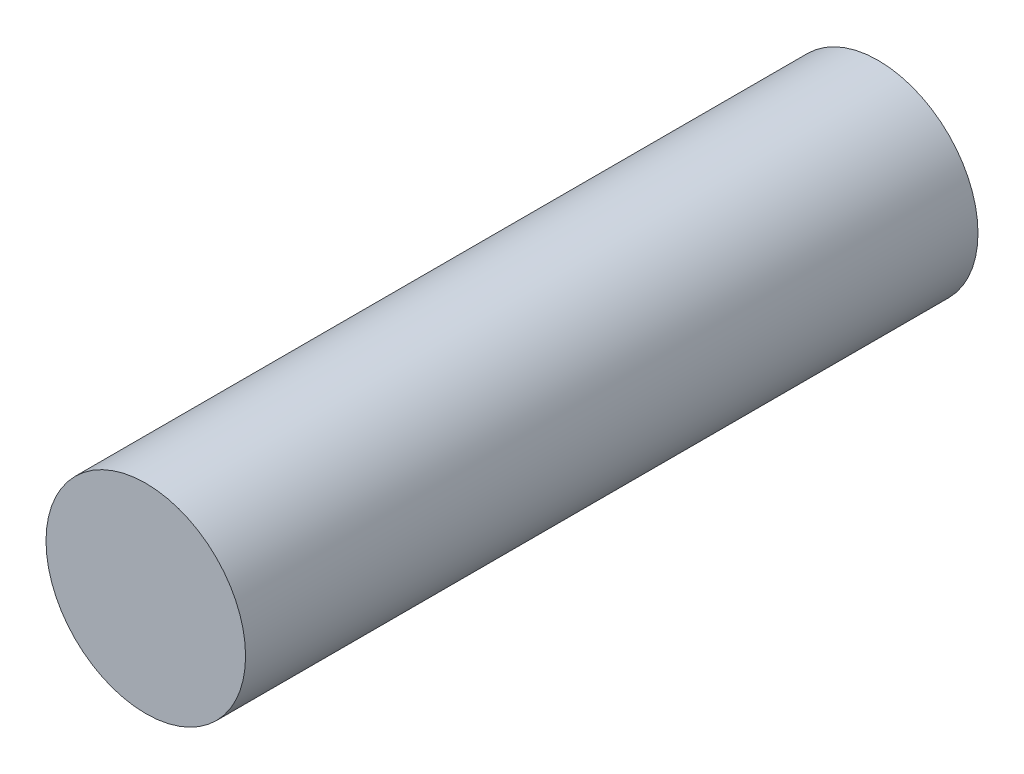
ISO-10303-21;
HEADER;
FILE_DESCRIPTION(('STEP AP214'),'2;1');
FILE_NAME('part.step','',(''),(''),'','','');
FILE_SCHEMA(('AUTOMOTIVE_DESIGN { 1 0 10303 214 1 1 1 1 }'));
ENDSEC;
DATA;
#1=APPLICATION_CONTEXT('core data for automotive mechanical design processes');
#2=APPLICATION_PROTOCOL_DEFINITION('international standard','automotive_design',2000,#1);
#3=PRODUCT_CONTEXT('',#1,'mechanical');
#4=PRODUCT('Part','Part','',(#3));
#5=PRODUCT_RELATED_PRODUCT_CATEGORY('part','',(#4));
#6=PRODUCT_DEFINITION_FORMATION('','',#4);
#7=PRODUCT_DEFINITION_CONTEXT('part definition',#1,'design');
#8=PRODUCT_DEFINITION('design','',#6,#7);
#9=PRODUCT_DEFINITION_SHAPE('','',#8);
#10=(LENGTH_UNIT() NAMED_UNIT(*) SI_UNIT(.MILLI.,.METRE.));
#11=(NAMED_UNIT(*) PLANE_ANGLE_UNIT() SI_UNIT($,.RADIAN.));
#12=(NAMED_UNIT(*) SI_UNIT($,.STERADIAN.) SOLID_ANGLE_UNIT());
#13=UNCERTAINTY_MEASURE_WITH_UNIT(LENGTH_MEASURE(1.E-05),#10,'distance_accuracy_value','');
#14=(GEOMETRIC_REPRESENTATION_CONTEXT(3) GLOBAL_UNCERTAINTY_ASSIGNED_CONTEXT((#13)) GLOBAL_UNIT_ASSIGNED_CONTEXT((#10,
#11,#12)) REPRESENTATION_CONTEXT('',''));
#15=CARTESIAN_POINT('',(0.,0.,0.));
#16=DIRECTION('',(0.,0.,1.));
#17=DIRECTION('',(1.,0.,0.));
#18=AXIS2_PLACEMENT_3D('',#15,#16,#17);
#19=CARTESIAN_POINT('',(0.,0.,17.526));
#20=DIRECTION('',(0.,0.,-1.));
#21=DIRECTION('',(-1.,0.,0.));
#22=AXIS2_PLACEMENT_3D('',#19,#20,#21);
#23=CYLINDRICAL_SURFACE('',#22,2.3876);
#24=CARTESIAN_POINT('',(0.,0.,17.526));
#25=DIRECTION('',(0.,0.,1.));
#26=DIRECTION('',(1.,0.,0.));
#27=AXIS2_PLACEMENT_3D('',#24,#25,#26);
#28=CIRCLE('',#27,2.3876);
#29=CARTESIAN_POINT('',(2.3876,0.,17.526));
#30=VERTEX_POINT('',#29);
#31=EDGE_CURVE('E10',#30,#30,#28,.T.);
#32=ORIENTED_EDGE('',*,*,#31,.F.);
#33=EDGE_LOOP('',(#32));
#34=FACE_BOUND('',#33,.T.);
#35=CARTESIAN_POINT('',(0.,0.,0.));
#36=DIRECTION('',(0.,0.,1.));
#37=DIRECTION('',(1.,0.,0.));
#38=AXIS2_PLACEMENT_3D('',#35,#36,#37);
#39=CIRCLE('',#38,2.3876);
#40=CARTESIAN_POINT('',(2.3876,0.,0.));
#41=VERTEX_POINT('',#40);
#42=EDGE_CURVE('E36',#41,#41,#39,.T.);
#43=ORIENTED_EDGE('',*,*,#42,.T.);
#44=EDGE_LOOP('',(#43));
#45=FACE_BOUND('',#44,.T.);
#46=ADVANCED_FACE('F30',(#34,#45),#23,.T.);
#47=CARTESIAN_POINT('',(0.,0.,17.526));
#48=DIRECTION('',(0.,0.,1.));
#49=DIRECTION('',(1.,0.,0.));
#50=AXIS2_PLACEMENT_3D('',#47,#48,#49);
#51=PLANE('',#50);
#52=ORIENTED_EDGE('',*,*,#31,.T.);
#53=EDGE_LOOP('',(#52));
#54=FACE_BOUND('',#53,.T.);
#55=ADVANCED_FACE('F45',(#54),#51,.T.);
#56=CARTESIAN_POINT('',(0.,0.,0.));
#57=DIRECTION('',(0.,0.,1.));
#58=DIRECTION('',(1.,0.,0.));
#59=AXIS2_PLACEMENT_3D('',#56,#57,#58);
#60=PLANE('',#59);
#61=ORIENTED_EDGE('',*,*,#42,.F.);
#62=EDGE_LOOP('',(#61));
#63=FACE_BOUND('',#62,.T.);
#64=ADVANCED_FACE('F43',(#63),#60,.F.);
#65=CLOSED_SHELL('',(#46,#55,#64));
#66=MANIFOLD_SOLID_BREP('B2',#65);
#67=ADVANCED_BREP_SHAPE_REPRESENTATION('',(#18,#66),#14);
#68=SHAPE_DEFINITION_REPRESENTATION(#9,#67);
ENDSEC;
END-ISO-10303-21;
